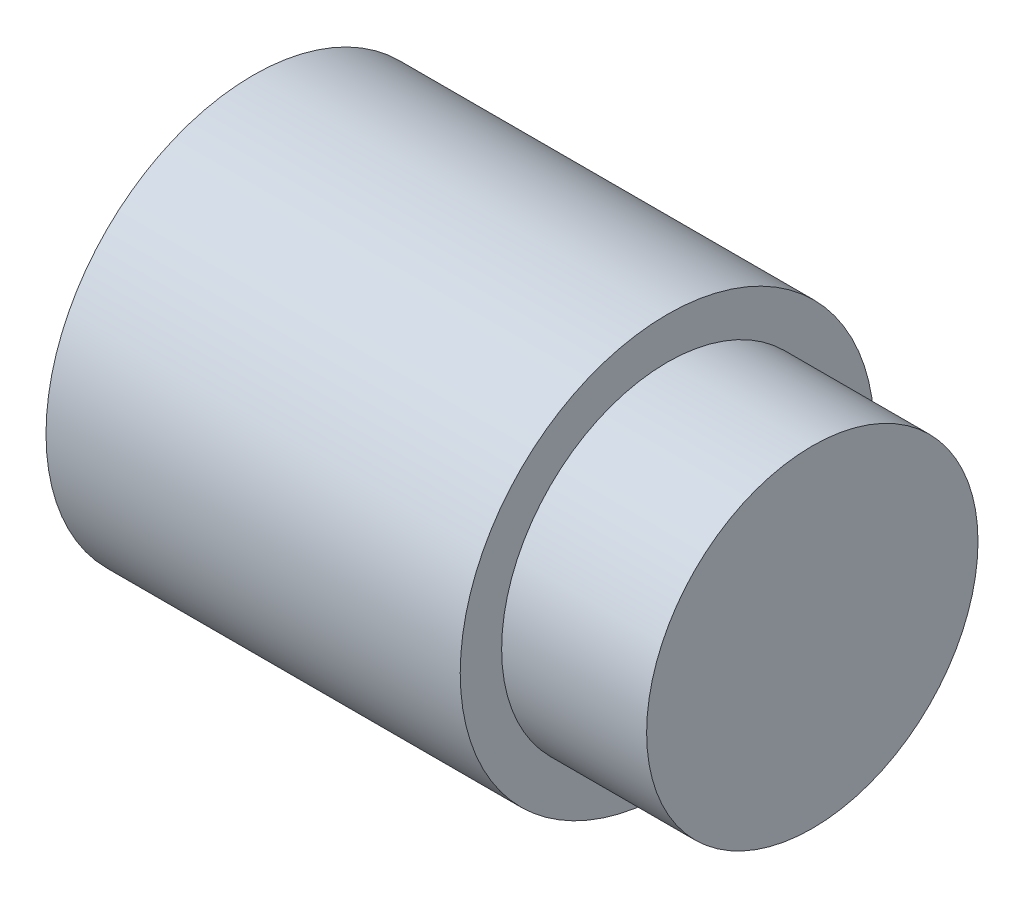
ISO-10303-21;
HEADER;
FILE_DESCRIPTION(('STEP AP214'),'2;1');
FILE_NAME('part.step','',(''),(''),'','','');
FILE_SCHEMA(('AUTOMOTIVE_DESIGN { 1 0 10303 214 1 1 1 1 }'));
ENDSEC;
DATA;
#1=APPLICATION_CONTEXT('core data for automotive mechanical design processes');
#2=APPLICATION_PROTOCOL_DEFINITION('international standard','automotive_design',2000,#1);
#3=PRODUCT_CONTEXT('',#1,'mechanical');
#4=PRODUCT('Part','Part','',(#3));
#5=PRODUCT_RELATED_PRODUCT_CATEGORY('part','',(#4));
#6=PRODUCT_DEFINITION_FORMATION('','',#4);
#7=PRODUCT_DEFINITION_CONTEXT('part definition',#1,'design');
#8=PRODUCT_DEFINITION('design','',#6,#7);
#9=PRODUCT_DEFINITION_SHAPE('','',#8);
#10=(LENGTH_UNIT() NAMED_UNIT(*) SI_UNIT(.MILLI.,.METRE.));
#11=(NAMED_UNIT(*) PLANE_ANGLE_UNIT() SI_UNIT($,.RADIAN.));
#12=(NAMED_UNIT(*) SI_UNIT($,.STERADIAN.) SOLID_ANGLE_UNIT());
#13=UNCERTAINTY_MEASURE_WITH_UNIT(LENGTH_MEASURE(1.E-05),#10,'distance_accuracy_value','');
#14=(GEOMETRIC_REPRESENTATION_CONTEXT(3) GLOBAL_UNCERTAINTY_ASSIGNED_CONTEXT((#13)) GLOBAL_UNIT_ASSIGNED_CONTEXT((#10,
#11,#12)) REPRESENTATION_CONTEXT('',''));
#15=CARTESIAN_POINT('',(0.,0.,0.));
#16=DIRECTION('',(0.,0.,1.));
#17=DIRECTION('',(1.,0.,0.));
#18=AXIS2_PLACEMENT_3D('',#15,#16,#17);
#19=CARTESIAN_POINT('',(0.,0.,-110.141421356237));
#20=DIRECTION('',(1.,0.,0.));
#21=DIRECTION('',(0.,0.,-1.));
#22=AXIS2_PLACEMENT_3D('',#19,#20,#21);
#23=PLANE('',#22);
#24=CARTESIAN_POINT('',(0.,0.,0.));
#25=DIRECTION('',(1.,0.,0.));
#26=DIRECTION('',(0.,0.,-1.));
#27=AXIS2_PLACEMENT_3D('',#24,#25,#26);
#28=CIRCLE('',#27,50.);
#29=CARTESIAN_POINT('',(0.,0.,-50.));
#30=VERTEX_POINT('',#29);
#31=EDGE_CURVE('E33',#30,#30,#28,.T.);
#32=ORIENTED_EDGE('',*,*,#31,.T.);
#33=EDGE_LOOP('',(#32));
#34=FACE_BOUND('',#33,.T.);
#35=CARTESIAN_POINT('',(0.,0.,0.));
#36=DIRECTION('',(1.,0.,0.));
#37=DIRECTION('',(0.,0.,-1.));
#38=AXIS2_PLACEMENT_3D('',#35,#36,#37);
#39=CIRCLE('',#38,40.);
#40=CARTESIAN_POINT('',(0.,0.,-40.));
#41=VERTEX_POINT('',#40);
#42=EDGE_CURVE('E42',#41,#41,#39,.T.);
#43=ORIENTED_EDGE('',*,*,#42,.F.);
#44=EDGE_LOOP('',(#43));
#45=FACE_BOUND('',#44,.T.);
#46=ADVANCED_FACE('F29',(#34,#45),#23,.T.);
#47=CARTESIAN_POINT('',(-100.,0.,0.));
#48=DIRECTION('',(1.,0.,0.));
#49=DIRECTION('',(0.,0.,-1.));
#50=AXIS2_PLACEMENT_3D('',#47,#48,#49);
#51=CYLINDRICAL_SURFACE('',#50,50.);
#52=CARTESIAN_POINT('',(-100.,0.,0.));
#53=DIRECTION('',(1.,0.,0.));
#54=DIRECTION('',(0.,0.,-1.));
#55=AXIS2_PLACEMENT_3D('',#52,#53,#54);
#56=CIRCLE('',#55,50.);
#57=CARTESIAN_POINT('',(-100.,0.,-50.));
#58=VERTEX_POINT('',#57);
#59=EDGE_CURVE('E10',#58,#58,#56,.T.);
#60=ORIENTED_EDGE('',*,*,#59,.T.);
#61=EDGE_LOOP('',(#60));
#62=FACE_BOUND('',#61,.T.);
#63=ORIENTED_EDGE('',*,*,#31,.F.);
#64=EDGE_LOOP('',(#63));
#65=FACE_BOUND('',#64,.T.);
#66=ADVANCED_FACE('F31',(#62,#65),#51,.T.);
#67=CARTESIAN_POINT('',(-100.,0.,-110.141421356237));
#68=DIRECTION('',(1.,0.,0.));
#69=DIRECTION('',(0.,0.,-1.));
#70=AXIS2_PLACEMENT_3D('',#67,#68,#69);
#71=PLANE('',#70);
#72=ORIENTED_EDGE('',*,*,#59,.F.);
#73=EDGE_LOOP('',(#72));
#74=FACE_BOUND('',#73,.T.);
#75=ADVANCED_FACE('F53',(#74),#71,.F.);
#76=CARTESIAN_POINT('',(35.,0.,0.));
#77=DIRECTION('',(-1.,0.,0.));
#78=DIRECTION('',(0.,0.,1.));
#79=AXIS2_PLACEMENT_3D('',#76,#77,#78);
#80=CYLINDRICAL_SURFACE('',#79,40.);
#81=CARTESIAN_POINT('',(35.,0.,0.));
#82=DIRECTION('',(1.,0.,0.));
#83=DIRECTION('',(0.,0.,-1.));
#84=AXIS2_PLACEMENT_3D('',#81,#82,#83);
#85=CIRCLE('',#84,40.);
#86=CARTESIAN_POINT('',(35.,0.,-40.));
#87=VERTEX_POINT('',#86);
#88=EDGE_CURVE('E40',#87,#87,#85,.T.);
#89=ORIENTED_EDGE('',*,*,#88,.F.);
#90=EDGE_LOOP('',(#89));
#91=FACE_BOUND('',#90,.T.);
#92=ORIENTED_EDGE('',*,*,#42,.T.);
#93=EDGE_LOOP('',(#92));
#94=FACE_BOUND('',#93,.T.);
#95=ADVANCED_FACE('F50',(#91,#94),#80,.T.);
#96=CARTESIAN_POINT('',(35.,0.,-110.141421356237));
#97=DIRECTION('',(1.,0.,0.));
#98=DIRECTION('',(0.,0.,-1.));
#99=AXIS2_PLACEMENT_3D('',#96,#97,#98);
#100=PLANE('',#99);
#101=ORIENTED_EDGE('',*,*,#88,.T.);
#102=EDGE_LOOP('',(#101));
#103=FACE_BOUND('',#102,.T.);
#104=ADVANCED_FACE('F48',(#103),#100,.T.);
#105=CLOSED_SHELL('',(#46,#66,#75,#95,#104));
#106=MANIFOLD_SOLID_BREP('B2',#105);
#107=ADVANCED_BREP_SHAPE_REPRESENTATION('',(#18,#106),#14);
#108=SHAPE_DEFINITION_REPRESENTATION(#9,#107);
ENDSEC;
END-ISO-10303-21;
